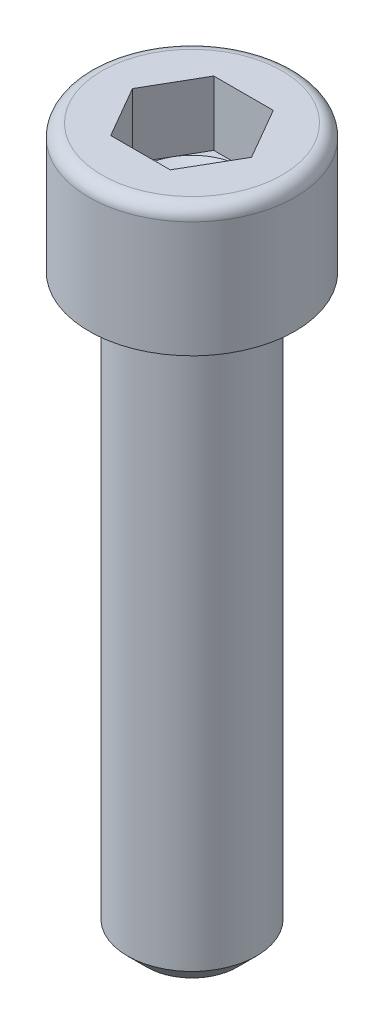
from build123d import *

# Parameters (mm, degrees)
TIGE_START              = -45
ESQUISSE1_R             = 5
TIGE_DEPTH              = 45
CHANFREIN_D_ENTR_E_SIZE = 1.5
HEXAGONE_DEPTH          = 5


with BuildPart() as part:
    # Esquisse1 → Tige (new body)
    with BuildSketch(Plane(origin=(0, 0, 0), x_dir=(1, 0, 0), z_dir=(0, 1, 0)).offset(TIGE_START)):
        with Locations(Location((0, 0, 0), (0, 0, 270))):
            Circle(ESQUISSE1_R)
    extrude(amount=TIGE_DEPTH)

    # Chanfrein d_entr_e
    chanfrein_d_entr_e_edges = [part.edges().sort_by_distance(p)[0] for p in [
        (0, -45, -5),
    ]]
    chamfer(chanfrein_d_entr_e_edges, length=CHANFREIN_D_ENTR_E_SIZE)

    # Esquisse2 → T_te (revolve)
    with BuildSketch(Plane.XY, mode=Mode.PRIVATE) as t_te_sk:
        with BuildLine():
            Line((4, 10), (4, 5))
            Line((4, 5), (0, 2.690598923))
            Line((0, 2.690598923), (0, 0))
            Line((0, 0), (8, 0))
            Line((8, 0), (8, 9))
            ThreePointArc((8, 9), (7.707106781, 9.707106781), (7, 10))
            Line((7, 10), (4, 10))
        make_face()
    revolve(t_te_sk.sketch.rotate(Axis((0, 10, 0), (0, -1, 0)), 180), axis=Axis((0, 10, 0), (0, -1, 0)))

    # Esquisse3 → Hexagone (cut)
    with BuildSketch(Plane(origin=(0, 10, -3), x_dir=(1, 0, 0), z_dir=(0, -1, 0))):
        Polygon((2.309401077, 7), (-2.309401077, 7), (-4.618802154, 3), (-2.309401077, -1), (2.309401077, -1), (4.618802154, 3), align=None)
    extrude(amount=HEXAGONE_DEPTH, mode=Mode.SUBTRACT)


solid = part.part
